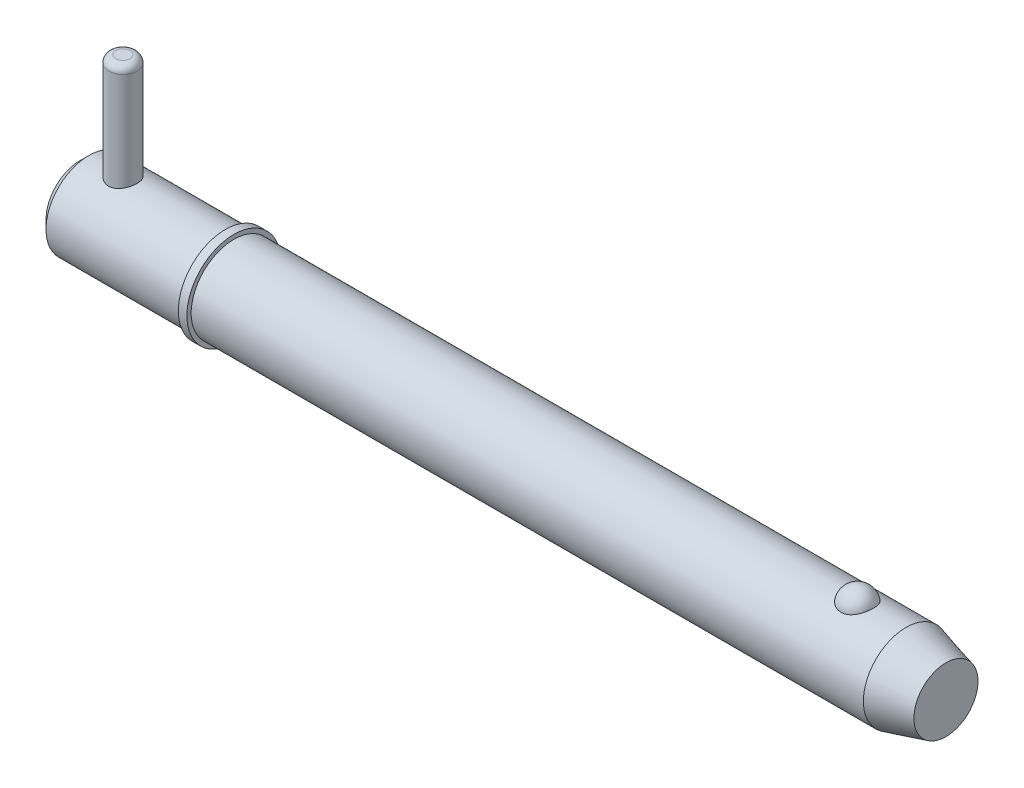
ISO-10303-21;
HEADER;
FILE_DESCRIPTION(('STEP AP214'),'2;1');
FILE_NAME('part.step','',(''),(''),'','','');
FILE_SCHEMA(('AUTOMOTIVE_DESIGN { 1 0 10303 214 1 1 1 1 }'));
ENDSEC;
DATA;
#1=APPLICATION_CONTEXT('core data for automotive mechanical design processes');
#2=APPLICATION_PROTOCOL_DEFINITION('international standard','automotive_design',2000,#1);
#3=PRODUCT_CONTEXT('',#1,'mechanical');
#4=PRODUCT('Part','Part','',(#3));
#5=PRODUCT_RELATED_PRODUCT_CATEGORY('part','',(#4));
#6=PRODUCT_DEFINITION_FORMATION('','',#4);
#7=PRODUCT_DEFINITION_CONTEXT('part definition',#1,'design');
#8=PRODUCT_DEFINITION('design','',#6,#7);
#9=PRODUCT_DEFINITION_SHAPE('','',#8);
#10=(LENGTH_UNIT() NAMED_UNIT(*) SI_UNIT(.MILLI.,.METRE.));
#11=(NAMED_UNIT(*) PLANE_ANGLE_UNIT() SI_UNIT($,.RADIAN.));
#12=(NAMED_UNIT(*) SI_UNIT($,.STERADIAN.) SOLID_ANGLE_UNIT());
#13=UNCERTAINTY_MEASURE_WITH_UNIT(LENGTH_MEASURE(1.E-05),#10,'distance_accuracy_value','');
#14=(GEOMETRIC_REPRESENTATION_CONTEXT(3) GLOBAL_UNCERTAINTY_ASSIGNED_CONTEXT((#13)) GLOBAL_UNIT_ASSIGNED_CONTEXT((#10,
#11,#12)) REPRESENTATION_CONTEXT('',''));
#15=CARTESIAN_POINT('',(0.,0.,0.));
#16=DIRECTION('',(0.,0.,1.));
#17=DIRECTION('',(1.,0.,0.));
#18=AXIS2_PLACEMENT_3D('',#15,#16,#17);
#19=CARTESIAN_POINT('',(7.14,24.605,0.));
#20=DIRECTION('',(0.,-1.,0.));
#21=DIRECTION('',(0.,0.,-1.));
#22=AXIS2_PLACEMENT_3D('',#19,#20,#21);
#23=CYLINDRICAL_SURFACE('',#22,2.38);
#24=CARTESIAN_POINT('',(7.14,-5.955,0.));
#25=DIRECTION('',(0.,1.,0.));
#26=DIRECTION('',(0.,0.,1.));
#27=AXIS2_PLACEMENT_3D('',#24,#25,#26);
#28=CIRCLE('',#27,2.38);
#29=CARTESIAN_POINT('',(7.14,-5.955,2.38));
#30=VERTEX_POINT('',#29);
#31=EDGE_CURVE('P0_E25',#30,#30,#28,.T.);
#32=ORIENTED_EDGE('',*,*,#31,.T.);
#33=EDGE_LOOP('',(#32));
#34=FACE_BOUND('',#33,.T.);
#35=CARTESIAN_POINT('',(7.14,23.415,0.));
#36=DIRECTION('',(0.,1.,0.));
#37=DIRECTION('',(0.,0.,1.));
#38=AXIS2_PLACEMENT_3D('',#35,#36,#37);
#39=CIRCLE('',#38,2.38);
#40=CARTESIAN_POINT('',(7.14,23.415,2.38));
#41=VERTEX_POINT('',#40);
#42=EDGE_CURVE('P0_E29',#41,#41,#39,.F.);
#43=ORIENTED_EDGE('',*,*,#42,.T.);
#44=EDGE_LOOP('',(#43));
#45=FACE_BOUND('',#44,.T.);
#46=ADVANCED_FACE('P0_F14',(#34,#45),#23,.T.);
#47=CARTESIAN_POINT('',(7.14,24.605,0.));
#48=DIRECTION('',(0.,1.,0.));
#49=DIRECTION('',(0.,0.,1.));
#50=AXIS2_PLACEMENT_3D('',#47,#48,#49);
#51=PLANE('',#50);
#52=CARTESIAN_POINT('',(7.14,24.605,0.));
#53=DIRECTION('',(0.,1.,0.));
#54=DIRECTION('',(0.,0.,1.));
#55=AXIS2_PLACEMENT_3D('',#52,#53,#54);
#56=CIRCLE('',#55,1.19);
#57=CARTESIAN_POINT('',(7.14,24.605,1.19));
#58=VERTEX_POINT('',#57);
#59=EDGE_CURVE('P0_E10',#58,#58,#56,.T.);
#60=ORIENTED_EDGE('',*,*,#59,.T.);
#61=EDGE_LOOP('',(#60));
#62=FACE_BOUND('',#61,.T.);
#63=ADVANCED_FACE('P0_F46',(#62),#51,.T.);
#64=CARTESIAN_POINT('',(7.14,-7.145,0.));
#65=DIRECTION('',(0.,1.,0.));
#66=DIRECTION('',(0.,0.,1.));
#67=AXIS2_PLACEMENT_3D('',#64,#65,#66);
#68=PLANE('',#67);
#69=CARTESIAN_POINT('',(7.14,-7.145,0.));
#70=DIRECTION('',(0.,1.,0.));
#71=DIRECTION('',(0.,0.,1.));
#72=AXIS2_PLACEMENT_3D('',#69,#70,#71);
#73=CIRCLE('',#72,1.19);
#74=CARTESIAN_POINT('',(7.14,-7.145,1.19));
#75=VERTEX_POINT('',#74);
#76=EDGE_CURVE('P0_E21',#75,#75,#73,.F.);
#77=ORIENTED_EDGE('',*,*,#76,.T.);
#78=EDGE_LOOP('',(#77));
#79=FACE_BOUND('',#78,.T.);
#80=ADVANCED_FACE('P0_F43',(#79),#68,.F.);
#81=CARTESIAN_POINT('',(7.14,-5.955,0.));
#82=DIRECTION('',(0.,1.,0.));
#83=DIRECTION('',(0.,0.,1.));
#84=AXIS2_PLACEMENT_3D('',#81,#82,#83);
#85=DEGENERATE_TOROIDAL_SURFACE('',#84,1.19,1.19,.T.);
#86=ORIENTED_EDGE('',*,*,#76,.F.);
#87=EDGE_LOOP('',(#86));
#88=FACE_BOUND('',#87,.T.);
#89=ORIENTED_EDGE('',*,*,#31,.F.);
#90=EDGE_LOOP('',(#89));
#91=FACE_BOUND('',#90,.T.);
#92=ADVANCED_FACE('P0_F38',(#88,#91),#85,.T.);
#93=CARTESIAN_POINT('',(7.14,23.415,0.));
#94=DIRECTION('',(0.,1.,0.));
#95=DIRECTION('',(0.,0.,1.));
#96=AXIS2_PLACEMENT_3D('',#93,#94,#95);
#97=DEGENERATE_TOROIDAL_SURFACE('',#96,1.19,1.19,.T.);
#98=ORIENTED_EDGE('',*,*,#42,.F.);
#99=EDGE_LOOP('',(#98));
#100=FACE_BOUND('',#99,.T.);
#101=ORIENTED_EDGE('',*,*,#59,.F.);
#102=EDGE_LOOP('',(#101));
#103=FACE_BOUND('',#102,.T.);
#104=ADVANCED_FACE('P0_F16',(#100,#103),#97,.T.);
#105=CLOSED_SHELL('',(#46,#63,#80,#92,#104));
#106=MANIFOLD_SOLID_BREP('P0_B1',#105);
#107=CARTESIAN_POINT('',(0.,0.,0.));
#108=DIRECTION('',(1.,0.,0.));
#109=DIRECTION('',(0.,0.,-1.));
#110=AXIS2_PLACEMENT_3D('',#107,#108,#109);
#111=CYLINDRICAL_SURFACE('',#110,7.145);
#112=CARTESIAN_POINT('',(138.08362424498,0.,0.));
#113=DIRECTION('',(1.,0.,0.));
#114=DIRECTION('',(0.,0.,-1.));
#115=AXIS2_PLACEMENT_3D('',#112,#113,#114);
#116=CIRCLE('',#115,7.145);
#117=CARTESIAN_POINT('',(138.08362424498,0.,-7.145));
#118=VERTEX_POINT('',#117);
#119=EDGE_CURVE('P1_E81',#118,#118,#116,.T.);
#120=ORIENTED_EDGE('',*,*,#119,.F.);
#121=EDGE_LOOP('',(#120));
#122=FACE_BOUND('',#121,.T.);
#123=CARTESIAN_POINT('',(25.7,0.,0.));
#124=DIRECTION('',(1.,0.,0.));
#125=DIRECTION('',(0.,0.,-1.));
#126=AXIS2_PLACEMENT_3D('',#123,#124,#125);
#127=CIRCLE('',#126,7.145);
#128=CARTESIAN_POINT('',(25.7,0.,-7.145));
#129=VERTEX_POINT('',#128);
#130=EDGE_CURVE('P1_E85',#129,#129,#127,.T.);
#131=ORIENTED_EDGE('',*,*,#130,.T.);
#132=EDGE_LOOP('',(#131));
#133=FACE_BOUND('',#132,.T.);
#134=CARTESIAN_POINT('',(129.939503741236,6.60328629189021,2.72903557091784));
#135=CARTESIAN_POINT('',(129.798315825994,6.60329644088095,2.7290249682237));
#136=CARTESIAN_POINT('',(129.656883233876,6.60799490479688,2.71772840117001));
#137=CARTESIAN_POINT('',(129.377955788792,6.62628236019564,2.6728193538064));
#138=CARTESIAN_POINT('',(129.240472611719,6.63989534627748,2.63914664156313));
#139=CARTESIAN_POINT('',(128.973889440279,6.67440775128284,2.55059642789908));
#140=CARTESIAN_POINT('',(128.844768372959,6.69528793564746,2.49577486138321));
#141=CARTESIAN_POINT('',(128.597869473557,6.74205585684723,2.36651799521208));
#142=CARTESIAN_POINT('',(128.480086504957,6.76794130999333,2.2920916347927));
#143=CARTESIAN_POINT('',(128.25516710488,6.82286177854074,2.12312937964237));
#144=CARTESIAN_POINT('',(128.148440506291,6.85196655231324,2.0280710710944));
#145=CARTESIAN_POINT('',(127.951918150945,6.90970232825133,1.82167822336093));
#146=CARTESIAN_POINT('',(127.862127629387,6.93833318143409,1.71033867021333));
#147=CARTESIAN_POINT('',(127.697667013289,6.9935167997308,1.46891951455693));
#148=CARTESIAN_POINT('',(127.623844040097,7.01992110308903,1.33822781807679));
#149=CARTESIAN_POINT('',(127.498088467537,7.06643385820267,1.0656656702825));
#150=CARTESIAN_POINT('',(127.44615735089,7.08654188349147,0.923794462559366));
#151=CARTESIAN_POINT('',(127.364732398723,7.11862399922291,0.630993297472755));
#152=CARTESIAN_POINT('',(127.335516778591,7.13049704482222,0.479974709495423));
#153=CARTESIAN_POINT('',(127.301174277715,7.14449484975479,0.174782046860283));
#154=CARTESIAN_POINT('',(127.296046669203,7.14661990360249,0.020608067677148));
#155=CARTESIAN_POINT('',(127.309938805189,7.14092465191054,-0.285506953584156));
#156=CARTESIAN_POINT('',(127.328810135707,7.1331654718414,-0.437455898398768));
#157=CARTESIAN_POINT('',(127.390062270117,7.10859076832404,-0.73577860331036));
#158=CARTESIAN_POINT('',(127.432443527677,7.0917750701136,-0.882152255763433));
#159=CARTESIAN_POINT('',(127.539934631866,7.05076716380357,-1.16543149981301));
#160=CARTESIAN_POINT('',(127.605075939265,7.02656475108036,-1.30232366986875));
#161=CARTESIAN_POINT('',(127.756759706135,6.97329145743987,-1.56265907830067));
#162=CARTESIAN_POINT('',(127.843303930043,6.94422017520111,-1.68610120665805));
#163=CARTESIAN_POINT('',(128.036465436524,6.88415108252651,-1.91671004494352));
#164=CARTESIAN_POINT('',(128.143180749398,6.85314438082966,-2.02379244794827));
#165=CARTESIAN_POINT('',(128.373974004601,6.79282069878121,-2.21787433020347));
#166=CARTESIAN_POINT('',(128.498050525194,6.76350358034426,-2.30487545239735));
#167=CARTESIAN_POINT('',(128.757678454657,6.71060580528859,-2.45458647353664));
#168=CARTESIAN_POINT('',(128.892938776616,6.68691885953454,-2.51776240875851));
#169=CARTESIAN_POINT('',(129.173277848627,6.64741247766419,-2.62030218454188));
#170=CARTESIAN_POINT('',(129.318352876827,6.63159007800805,-2.65967499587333));
#171=CARTESIAN_POINT('',(129.606347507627,6.61038594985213,-2.71193301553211));
#172=CARTESIAN_POINT('',(129.74900807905,6.60451880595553,-2.72605165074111));
#173=CARTESIAN_POINT('',(130.034800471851,6.60240611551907,-2.73116688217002));
#174=CARTESIAN_POINT('',(130.177932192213,6.60615862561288,-2.7221681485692));
#175=CARTESIAN_POINT('',(130.455848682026,6.62256094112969,-2.68200435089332));
#176=CARTESIAN_POINT('',(130.590754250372,6.63492533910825,-2.65154998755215));
#177=CARTESIAN_POINT('',(130.85332009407,6.66687445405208,-2.57015684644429));
#178=CARTESIAN_POINT('',(130.98097978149,6.68645975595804,-2.51921640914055));
#179=CARTESIAN_POINT('',(131.228577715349,6.73127274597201,-2.39693610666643));
#180=CARTESIAN_POINT('',(131.348287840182,6.7566138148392,-2.32517694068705));
#181=CARTESIAN_POINT('',(131.574159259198,6.81006003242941,-2.16363812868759));
#182=CARTESIAN_POINT('',(131.680317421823,6.83816581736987,-2.07385432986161));
#183=CARTESIAN_POINT('',(131.881862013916,6.89580469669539,-1.87357235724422));
#184=CARTESIAN_POINT('',(131.976440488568,6.92533863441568,-1.76226074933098));
#185=CARTESIAN_POINT('',(132.146332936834,6.98139526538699,-1.5251169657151));
#186=CARTESIAN_POINT('',(132.221643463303,7.0079174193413,-1.39928219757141));
#187=CARTESIAN_POINT('',(132.353595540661,7.05607625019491,-1.1321597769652));
#188=CARTESIAN_POINT('',(132.409568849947,7.07753119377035,-0.990508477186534));
#189=CARTESIAN_POINT('',(132.498296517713,7.11222355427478,-0.699154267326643));
#190=CARTESIAN_POINT('',(132.531050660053,7.12546089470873,-0.549451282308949));
#191=CARTESIAN_POINT('',(132.572689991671,7.14237584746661,-0.246120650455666));
#192=CARTESIAN_POINT('',(132.581558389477,7.14604673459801,-0.0924903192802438));
#193=CARTESIAN_POINT('',(132.575194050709,7.14343510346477,0.214181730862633));
#194=CARTESIAN_POINT('',(132.559961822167,7.13715279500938,0.367223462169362));
#195=CARTESIAN_POINT('',(132.505845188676,7.1153294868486,0.667595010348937));
#196=CARTESIAN_POINT('',(132.467077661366,7.09983424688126,0.814949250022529));
#197=CARTESIAN_POINT('',(132.366770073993,7.06119140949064,1.1006322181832));
#198=CARTESIAN_POINT('',(132.305228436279,7.03804328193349,1.23896032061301));
#199=CARTESIAN_POINT('',(132.160207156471,6.98632429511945,1.50352300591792));
#200=CARTESIAN_POINT('',(132.076606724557,6.95772382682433,1.62968561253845));
#201=CARTESIAN_POINT('',(131.88938046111,6.89823072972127,1.86554304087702));
#202=CARTESIAN_POINT('',(131.785755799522,6.86733823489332,1.97523882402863));
#203=CARTESIAN_POINT('',(131.561076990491,6.80676456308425,2.174822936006));
#204=CARTESIAN_POINT('',(131.440067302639,6.7770805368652,2.26476035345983));
#205=CARTESIAN_POINT('',(131.183340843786,6.7223050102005,2.42252989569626));
#206=CARTESIAN_POINT('',(131.04761851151,6.69721525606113,2.4903536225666));
#207=CARTESIAN_POINT('',(130.770402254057,6.65552591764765,2.59967646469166));
#208=CARTESIAN_POINT('',(130.629281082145,6.63865794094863,2.6420201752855));
#209=CARTESIAN_POINT('',(130.341444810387,6.61425039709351,2.70255841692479));
#210=CARTESIAN_POINT('',(130.194748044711,6.606682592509,2.72082606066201));
#211=CARTESIAN_POINT('',(130.011679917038,6.60358754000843,2.72830331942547));
#212=CARTESIAN_POINT('',(129.975599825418,6.60328369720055,2.72903828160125));
#213=CARTESIAN_POINT('',(129.939503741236,6.60328629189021,2.72903557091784));
#214=B_SPLINE_CURVE_WITH_KNOTS('',3,(#134,#135,#136,#137,#138,#139,#140,#141,#142,#143,#144,
#145,#146,#147,#148,#149,#150,#151,#152,#153,#154,#155,#156,#157,#158,#159,#160,#161,#162,#163,
#164,#165,#166,#167,#168,#169,#170,#171,#172,#173,#174,#175,#176,#177,#178,#179,#180,#181,#182,
#183,#184,#185,#186,#187,#188,#189,#190,#191,#192,#193,#194,#195,#196,#197,#198,#199,#200,#201,
#202,#203,#204,#205,#206,#207,#208,#209,#210,#211,#212,#213),.UNSPECIFIED.,.T.,.F.,(4,2,2,2,2,2,
2,2,2,2,2,2,2,2,2,2,2,2,2,2,2,2,2,2,2,2,2,2,2,2,2,2,2,2,2,2,2,2,2,4),(0.,0.423468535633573,
0.848081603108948,1.27157926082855,1.69488414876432,2.13051395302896,2.56627819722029,
3.02136706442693,3.47648674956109,3.93709649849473,4.39769233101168,4.85545355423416,
5.31322361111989,5.77162895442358,6.23007210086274,6.6908033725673,7.15149693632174,
7.60264329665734,8.05361952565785,8.48189729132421,8.91008854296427,9.32472524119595,
9.73939553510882,10.1630783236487,10.5868588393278,11.0319070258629,11.4770347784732,
11.9362874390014,12.3955443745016,12.8551240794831,13.3146940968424,13.7720003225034,
14.2293382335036,14.6892343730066,15.1491036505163,15.6078171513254,16.0667046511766,
16.5093965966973,16.9507410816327,17.0590049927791),.UNSPECIFIED.);
#215=CARTESIAN_POINT('',(129.939503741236,6.60328629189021,2.72903557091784));
#216=VERTEX_POINT('',#215);
#217=EDGE_CURVE('P1_E35',#216,#216,#214,.T.);
#218=ORIENTED_EDGE('',*,*,#217,.T.);
#219=EDGE_LOOP('',(#218));
#220=FACE_BOUND('',#219,.T.);
#221=ADVANCED_FACE('P1_F13',(#122,#133,#220),#111,.T.);
#222=CARTESIAN_POINT('',(0.,0.,0.));
#223=DIRECTION('',(-1.,0.,0.));
#224=DIRECTION('',(0.,0.,1.));
#225=AXIS2_PLACEMENT_3D('',#222,#223,#224);
#226=PLANE('',#225);
#227=CARTESIAN_POINT('',(0.,0.,0.));
#228=DIRECTION('',(1.,0.,0.));
#229=DIRECTION('',(0.,0.,-1.));
#230=AXIS2_PLACEMENT_3D('',#227,#228,#229);
#231=CIRCLE('',#230,5.716);
#232=CARTESIAN_POINT('',(0.,0.,-5.716));
#233=VERTEX_POINT('',#232);
#234=EDGE_CURVE('P1_E9',#233,#233,#231,.T.);
#235=ORIENTED_EDGE('',*,*,#234,.F.);
#236=EDGE_LOOP('',(#235));
#237=FACE_BOUND('',#236,.T.);
#238=ADVANCED_FACE('P1_F15',(#237),#226,.T.);
#239=CARTESIAN_POINT('',(1.42899999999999,0.,0.));
#240=DIRECTION('',(1.,0.,0.));
#241=DIRECTION('',(0.,0.,-1.));
#242=AXIS2_PLACEMENT_3D('',#239,#240,#241);
#243=CONICAL_SURFACE('',#242,7.145,0.78539816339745);
#244=ORIENTED_EDGE('',*,*,#234,.T.);
#245=EDGE_LOOP('',(#244));
#246=FACE_BOUND('',#245,.T.);
#247=CARTESIAN_POINT('',(1.42899999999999,0.,0.));
#248=DIRECTION('',(1.,0.,0.));
#249=DIRECTION('',(0.,0.,-1.));
#250=AXIS2_PLACEMENT_3D('',#247,#248,#249);
#251=CIRCLE('',#250,7.145);
#252=CARTESIAN_POINT('',(1.42899999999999,0.,-7.145));
#253=VERTEX_POINT('',#252);
#254=EDGE_CURVE('P1_E26',#253,#253,#251,.T.);
#255=ORIENTED_EDGE('',*,*,#254,.F.);
#256=EDGE_LOOP('',(#255));
#257=FACE_BOUND('',#256,.T.);
#258=ADVANCED_FACE('P1_F77',(#246,#257),#243,.T.);
#259=CARTESIAN_POINT('',(0.,0.,0.));
#260=DIRECTION('',(1.,0.,0.));
#261=DIRECTION('',(0.,0.,-1.));
#262=AXIS2_PLACEMENT_3D('',#259,#260,#261);
#263=CYLINDRICAL_SURFACE('',#262,7.145);
#264=CARTESIAN_POINT('',(7.14,-6.73695962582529,2.38));
#265=CARTESIAN_POINT('',(7.01035997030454,-6.73695921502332,2.38000059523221));
#266=CARTESIAN_POINT('',(6.88072348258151,-6.74074253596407,2.36937183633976));
#267=CARTESIAN_POINT('',(6.62529075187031,-6.75538853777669,2.32728080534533));
#268=CARTESIAN_POINT('',(6.49949514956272,-6.76625239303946,2.29581507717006));
#269=CARTESIAN_POINT('',(6.2554858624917,-6.79369535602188,2.21327763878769));
#270=CARTESIAN_POINT('',(6.13725786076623,-6.81026326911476,2.16224430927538));
#271=CARTESIAN_POINT('',(5.91100349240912,-6.84723128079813,2.04215132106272));
#272=CARTESIAN_POINT('',(5.80297937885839,-6.86763222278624,1.97308769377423));
#273=CARTESIAN_POINT('',(5.59597854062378,-6.91086152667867,1.81600414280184));
#274=CARTESIAN_POINT('',(5.49745861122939,-6.93375032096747,1.72739874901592));
#275=CARTESIAN_POINT('',(5.31636508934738,-6.97886546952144,1.53499636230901));
#276=CARTESIAN_POINT('',(5.23379405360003,-7.00109171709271,1.43119693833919));
#277=CARTESIAN_POINT('',(5.08487013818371,-7.04307708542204,1.20801318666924));
#278=CARTESIAN_POINT('',(5.01899578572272,-7.06275685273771,1.08829330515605));
#279=CARTESIAN_POINT('',(4.90850130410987,-7.09671988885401,0.838703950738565));
#280=CARTESIAN_POINT('',(4.86387545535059,-7.11100460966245,0.70883722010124));
#281=CARTESIAN_POINT('',(4.79869354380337,-7.13213998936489,0.44742990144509));
#282=CARTESIAN_POINT('',(4.77735497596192,-7.13923172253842,0.316104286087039));
#283=CARTESIAN_POINT('',(4.75686536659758,-7.14603777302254,0.0515578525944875));
#284=CARTESIAN_POINT('',(4.75770861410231,-7.14575398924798,-0.0816624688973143));
#285=CARTESIAN_POINT('',(4.78106216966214,-7.13800438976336,-0.340678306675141));
#286=CARTESIAN_POINT('',(4.80272255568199,-7.13082030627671,-0.466560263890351));
#287=CARTESIAN_POINT('',(4.86569013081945,-7.11043095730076,-0.712788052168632));
#288=CARTESIAN_POINT('',(4.90699865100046,-7.09722528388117,-0.833133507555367));
#289=CARTESIAN_POINT('',(5.00858673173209,-7.06591754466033,-1.06673173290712));
#290=CARTESIAN_POINT('',(5.06910834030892,-7.0477534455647,-1.17987058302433));
#291=CARTESIAN_POINT('',(5.20720514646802,-7.00841977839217,-1.39463797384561));
#292=CARTESIAN_POINT('',(5.28478508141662,-6.987249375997,-1.49626330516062));
#293=CARTESIAN_POINT('',(5.4590800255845,-6.94296010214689,-1.69017445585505));
#294=CARTESIAN_POINT('',(5.55652324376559,-6.91979641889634,-1.78179645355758));
#295=CARTESIAN_POINT('',(5.76558873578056,-6.87497076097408,-1.94761348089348));
#296=CARTESIAN_POINT('',(5.87721318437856,-6.85330901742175,-2.02180583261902));
#297=CARTESIAN_POINT('',(6.11357367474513,-6.81369485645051,-2.15157488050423));
#298=CARTESIAN_POINT('',(6.23847358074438,-6.79579956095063,-2.20687188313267));
#299=CARTESIAN_POINT('',(6.49655785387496,-6.76640630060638,-2.29542443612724));
#300=CARTESIAN_POINT('',(6.62973872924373,-6.75490565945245,-2.32868920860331));
#301=CARTESIAN_POINT('',(6.89417536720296,-6.74020933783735,-2.37088225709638));
#302=CARTESIAN_POINT('',(7.02524746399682,-6.73666278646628,-2.38083959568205));
#303=CARTESIAN_POINT('',(7.28721035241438,-6.73729555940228,-2.37904974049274));
#304=CARTESIAN_POINT('',(7.41810117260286,-6.7414734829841,-2.36730648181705));
#305=CARTESIAN_POINT('',(7.67130717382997,-6.75673471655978,-2.32337336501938));
#306=CARTESIAN_POINT('',(7.79376251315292,-6.76757635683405,-2.29189834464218));
#307=CARTESIAN_POINT('',(8.03162917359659,-6.79467771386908,-2.21025275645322));
#308=CARTESIAN_POINT('',(8.14703924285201,-6.8109383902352,-2.16007887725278));
#309=CARTESIAN_POINT('',(8.37159169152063,-6.84768362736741,-2.04065289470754));
#310=CARTESIAN_POINT('',(8.48041962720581,-6.86828569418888,-1.97084668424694));
#311=CARTESIAN_POINT('',(8.68518919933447,-6.91116416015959,-1.8147657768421));
#312=CARTESIAN_POINT('',(8.78112702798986,-6.93344105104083,-1.72848623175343));
#313=CARTESIAN_POINT('',(8.96215574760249,-6.97845348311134,-1.53698616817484));
#314=CARTESIAN_POINT('',(9.04650427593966,-7.00115965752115,-1.43105491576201));
#315=CARTESIAN_POINT('',(9.19627592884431,-7.04341676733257,-1.20598377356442));
#316=CARTESIAN_POINT('',(9.26169972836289,-7.06296781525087,-1.08684435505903));
#317=CARTESIAN_POINT('',(9.37116617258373,-7.0966205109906,-0.83933303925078));
#318=CARTESIAN_POINT('',(9.41534821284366,-7.11075755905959,-0.711027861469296));
#319=CARTESIAN_POINT('',(9.48132660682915,-7.13214194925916,-0.448245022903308));
#320=CARTESIAN_POINT('',(9.50313102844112,-7.13939177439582,-0.313769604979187));
#321=CARTESIAN_POINT('',(9.5230098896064,-7.14599771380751,-0.049254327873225));
#322=CARTESIAN_POINT('',(9.52215013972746,-7.14570837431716,0.0806974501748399));
#323=CARTESIAN_POINT('',(9.49935359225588,-7.13814116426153,0.338518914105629));
#324=CARTESIAN_POINT('',(9.47741850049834,-7.13086385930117,0.466388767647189));
#325=CARTESIAN_POINT('',(9.4138005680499,-7.11026814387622,0.714400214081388));
#326=CARTESIAN_POINT('',(9.37243609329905,-7.09704726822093,0.834632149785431));
#327=CARTESIAN_POINT('',(9.27142829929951,-7.06592602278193,1.06649582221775));
#328=CARTESIAN_POINT('',(9.2117816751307,-7.04802480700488,1.1781259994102));
#329=CARTESIAN_POINT('',(9.07336776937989,-7.00856499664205,1.39411030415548));
#330=CARTESIAN_POINT('',(8.99397590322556,-6.98689577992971,1.49804368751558));
#331=CARTESIAN_POINT('',(8.81938810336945,-6.9426110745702,1.69146078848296));
#332=CARTESIAN_POINT('',(8.72418713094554,-6.91999528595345,1.78093988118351));
#333=CARTESIAN_POINT('',(8.51623540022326,-6.87531507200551,1.94646188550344));
#334=CARTESIAN_POINT('',(8.4029442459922,-6.85330672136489,2.02184316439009));
#335=CARTESIAN_POINT('',(8.16461714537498,-6.81342065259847,2.1524427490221));
#336=CARTESIAN_POINT('',(8.03958429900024,-6.7955418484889,2.20766635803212));
#337=CARTESIAN_POINT('',(7.78712566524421,-6.76686117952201,2.29403636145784));
#338=CARTESIAN_POINT('',(7.66006989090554,-6.75577342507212,2.32616709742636));
#339=CARTESIAN_POINT('',(7.40200728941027,-6.74082409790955,2.36914495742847));
#340=CARTESIAN_POINT('',(7.27100183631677,-6.73696004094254,2.37999939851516));
#341=CARTESIAN_POINT('',(7.14,-6.73695962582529,2.38));
#342=B_SPLINE_CURVE_WITH_KNOTS('',3,(#264,#265,#266,#267,#268,#269,#270,#271,#272,#273,#274,
#275,#276,#277,#278,#279,#280,#281,#282,#283,#284,#285,#286,#287,#288,#289,#290,#291,#292,#293,
#294,#295,#296,#297,#298,#299,#300,#301,#302,#303,#304,#305,#306,#307,#308,#309,#310,#311,#312,
#313,#314,#315,#316,#317,#318,#319,#320,#321,#322,#323,#324,#325,#326,#327,#328,#329,#330,#331,
#332,#333,#334,#335,#336,#337,#338,#339,#340,#341),.UNSPECIFIED.,.T.,.F.,(4,2,2,2,2,2,2,2,2,2,2,
2,2,2,2,2,2,2,2,2,2,2,2,2,2,2,2,2,2,2,2,2,2,2,2,2,2,2,4),(0.,0.388434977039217,
0.776934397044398,1.16467566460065,1.55250234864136,1.9540847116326,2.35573139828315,
2.76784120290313,3.17984001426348,3.57752248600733,3.97510257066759,4.35711073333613,
4.7391447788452,5.12619663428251,5.51335611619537,5.91871976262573,6.3241456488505,
6.73533623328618,7.14635459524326,7.53885245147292,7.93127914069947,8.31025106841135,
8.68929014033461,9.08033871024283,9.47150254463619,9.88145528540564,10.2913934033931,
10.6986033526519,11.1056664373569,11.4936225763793,11.8815473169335,12.2633262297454,
12.645174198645,13.0411187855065,13.437189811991,13.8487371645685,14.2601761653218,
14.6528265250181,15.0453418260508),.UNSPECIFIED.);
#343=CARTESIAN_POINT('',(7.14,-6.73695962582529,2.38));
#344=VERTEX_POINT('',#343);
#345=EDGE_CURVE('P1_E17',#344,#344,#342,.T.);
#346=ORIENTED_EDGE('',*,*,#345,.F.);
#347=EDGE_LOOP('',(#346));
#348=FACE_BOUND('',#347,.T.);
#349=CARTESIAN_POINT('',(7.14,6.73695962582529,2.38));
#350=CARTESIAN_POINT('',(7.26964002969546,6.73695921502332,2.38000059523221));
#351=CARTESIAN_POINT('',(7.39927651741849,6.74074253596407,2.36937183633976));
#352=CARTESIAN_POINT('',(7.65470924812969,6.75538853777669,2.32728080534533));
#353=CARTESIAN_POINT('',(7.78050485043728,6.76625239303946,2.29581507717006));
#354=CARTESIAN_POINT('',(8.02451413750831,6.79369535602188,2.21327763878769));
#355=CARTESIAN_POINT('',(8.14274213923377,6.81026326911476,2.16224430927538));
#356=CARTESIAN_POINT('',(8.36899650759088,6.84723128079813,2.04215132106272));
#357=CARTESIAN_POINT('',(8.47702062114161,6.86763222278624,1.97308769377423));
#358=CARTESIAN_POINT('',(8.68402145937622,6.91086152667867,1.81600414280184));
#359=CARTESIAN_POINT('',(8.78254138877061,6.93375032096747,1.72739874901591));
#360=CARTESIAN_POINT('',(8.96363491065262,6.97886546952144,1.53499636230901));
#361=CARTESIAN_POINT('',(9.04620594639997,7.00109171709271,1.43119693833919));
#362=CARTESIAN_POINT('',(9.19512986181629,7.04307708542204,1.20801318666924));
#363=CARTESIAN_POINT('',(9.26100421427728,7.06275685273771,1.08829330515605));
#364=CARTESIAN_POINT('',(9.37149869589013,7.09671988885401,0.838703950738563));
#365=CARTESIAN_POINT('',(9.41612454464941,7.11100460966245,0.708837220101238));
#366=CARTESIAN_POINT('',(9.48130645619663,7.13213998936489,0.447429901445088));
#367=CARTESIAN_POINT('',(9.50264502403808,7.13923172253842,0.316104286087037));
#368=CARTESIAN_POINT('',(9.52313463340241,7.14603777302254,0.0515578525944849));
#369=CARTESIAN_POINT('',(9.52229138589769,7.14575398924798,-0.0816624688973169));
#370=CARTESIAN_POINT('',(9.49893783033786,7.13800438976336,-0.340678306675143));
#371=CARTESIAN_POINT('',(9.47727744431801,7.13082030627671,-0.466560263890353));
#372=CARTESIAN_POINT('',(9.41430986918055,7.11043095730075,-0.712788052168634));
#373=CARTESIAN_POINT('',(9.37300134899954,7.09722528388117,-0.833133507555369));
#374=CARTESIAN_POINT('',(9.27141326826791,7.06591754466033,-1.06673173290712));
#375=CARTESIAN_POINT('',(9.21089165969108,7.0477534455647,-1.17987058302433));
#376=CARTESIAN_POINT('',(9.07279485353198,7.00841977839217,-1.39463797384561));
#377=CARTESIAN_POINT('',(8.99521491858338,6.987249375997,-1.49626330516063));
#378=CARTESIAN_POINT('',(8.82091997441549,6.94296010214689,-1.69017445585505));
#379=CARTESIAN_POINT('',(8.72347675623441,6.91979641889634,-1.78179645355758));
#380=CARTESIAN_POINT('',(8.51441126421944,6.87497076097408,-1.94761348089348));
#381=CARTESIAN_POINT('',(8.40278681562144,6.85330901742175,-2.02180583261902));
#382=CARTESIAN_POINT('',(8.16642632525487,6.81369485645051,-2.15157488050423));
#383=CARTESIAN_POINT('',(8.04152641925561,6.79579956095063,-2.20687188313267));
#384=CARTESIAN_POINT('',(7.78344214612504,6.76640630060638,-2.29542443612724));
#385=CARTESIAN_POINT('',(7.65026127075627,6.75490565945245,-2.32868920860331));
#386=CARTESIAN_POINT('',(7.38582463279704,6.74020933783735,-2.37088225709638));
#387=CARTESIAN_POINT('',(7.25475253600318,6.73666278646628,-2.38083959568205));
#388=CARTESIAN_POINT('',(6.99278964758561,6.73729555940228,-2.37904974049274));
#389=CARTESIAN_POINT('',(6.86189882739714,6.7414734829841,-2.36730648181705));
#390=CARTESIAN_POINT('',(6.60869282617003,6.75673471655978,-2.32337336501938));
#391=CARTESIAN_POINT('',(6.48623748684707,6.76757635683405,-2.29189834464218));
#392=CARTESIAN_POINT('',(6.2483708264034,6.79467771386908,-2.21025275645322));
#393=CARTESIAN_POINT('',(6.13296075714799,6.8109383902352,-2.16007887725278));
#394=CARTESIAN_POINT('',(5.90840830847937,6.84768362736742,-2.04065289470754));
#395=CARTESIAN_POINT('',(5.79958037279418,6.86828569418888,-1.97084668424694));
#396=CARTESIAN_POINT('',(5.59481080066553,6.91116416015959,-1.8147657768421));
#397=CARTESIAN_POINT('',(5.49887297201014,6.93344105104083,-1.72848623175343));
#398=CARTESIAN_POINT('',(5.31784425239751,6.97845348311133,-1.53698616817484));
#399=CARTESIAN_POINT('',(5.23349572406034,7.00115965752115,-1.43105491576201));
#400=CARTESIAN_POINT('',(5.08372407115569,7.04341676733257,-1.20598377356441));
#401=CARTESIAN_POINT('',(5.01830027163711,7.06296781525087,-1.08684435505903));
#402=CARTESIAN_POINT('',(4.90883382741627,7.0966205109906,-0.839333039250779));
#403=CARTESIAN_POINT('',(4.86465178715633,7.11075755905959,-0.711027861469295));
#404=CARTESIAN_POINT('',(4.79867339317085,7.13214194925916,-0.448245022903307));
#405=CARTESIAN_POINT('',(4.77686897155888,7.13939177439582,-0.313769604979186));
#406=CARTESIAN_POINT('',(4.7569901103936,7.14599771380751,-0.0492543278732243));
#407=CARTESIAN_POINT('',(4.75784986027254,7.14570837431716,0.0806974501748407));
#408=CARTESIAN_POINT('',(4.78064640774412,7.13814116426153,0.33851891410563));
#409=CARTESIAN_POINT('',(4.80258149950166,7.13086385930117,0.46638876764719));
#410=CARTESIAN_POINT('',(4.8661994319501,7.11026814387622,0.714400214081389));
#411=CARTESIAN_POINT('',(4.90756390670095,7.09704726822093,0.834632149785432));
#412=CARTESIAN_POINT('',(5.00857170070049,7.06592602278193,1.06649582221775));
#413=CARTESIAN_POINT('',(5.0682183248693,7.04802480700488,1.1781259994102));
#414=CARTESIAN_POINT('',(5.20663223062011,7.00856499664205,1.39411030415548));
#415=CARTESIAN_POINT('',(5.28602409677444,6.98689577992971,1.49804368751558));
#416=CARTESIAN_POINT('',(5.46061189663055,6.9426110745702,1.69146078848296));
#417=CARTESIAN_POINT('',(5.55581286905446,6.91999528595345,1.78093988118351));
#418=CARTESIAN_POINT('',(5.76376459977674,6.87531507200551,1.94646188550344));
#419=CARTESIAN_POINT('',(5.8770557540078,6.85330672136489,2.02184316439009));
#420=CARTESIAN_POINT('',(6.11538285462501,6.81342065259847,2.1524427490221));
#421=CARTESIAN_POINT('',(6.24041570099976,6.7955418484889,2.20766635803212));
#422=CARTESIAN_POINT('',(6.4928743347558,6.76686117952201,2.29403636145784));
#423=CARTESIAN_POINT('',(6.61993010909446,6.75577342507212,2.32616709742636));
#424=CARTESIAN_POINT('',(6.87799271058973,6.74082409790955,2.36914495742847));
#425=CARTESIAN_POINT('',(7.00899816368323,6.73696004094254,2.37999939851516));
#426=CARTESIAN_POINT('',(7.14,6.73695962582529,2.38));
#427=B_SPLINE_CURVE_WITH_KNOTS('',3,(#349,#350,#351,#352,#353,#354,#355,#356,#357,#358,#359,
#360,#361,#362,#363,#364,#365,#366,#367,#368,#369,#370,#371,#372,#373,#374,#375,#376,#377,#378,
#379,#380,#381,#382,#383,#384,#385,#386,#387,#388,#389,#390,#391,#392,#393,#394,#395,#396,#397,
#398,#399,#400,#401,#402,#403,#404,#405,#406,#407,#408,#409,#410,#411,#412,#413,#414,#415,#416,
#417,#418,#419,#420,#421,#422,#423,#424,#425,#426),.UNSPECIFIED.,.T.,.F.,(4,2,2,2,2,2,2,2,2,2,2,
2,2,2,2,2,2,2,2,2,2,2,2,2,2,2,2,2,2,2,2,2,2,2,2,2,2,2,4),(0.,0.388434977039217,
0.776934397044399,1.16467566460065,1.55250234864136,1.9540847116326,2.35573139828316,
2.76784120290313,3.17984001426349,3.57752248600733,3.97510257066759,4.35711073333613,
4.73914477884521,5.12619663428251,5.51335611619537,5.91871976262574,6.3241456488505,
6.73533623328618,7.14635459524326,7.53885245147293,7.93127914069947,8.31025106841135,
8.68929014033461,9.08033871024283,9.47150254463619,9.88145528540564,10.2913934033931,
10.6986033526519,11.1056664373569,11.4936225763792,11.8815473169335,12.2633262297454,
12.645174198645,13.0411187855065,13.437189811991,13.8487371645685,14.2601761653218,
14.6528265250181,15.0453418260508),.UNSPECIFIED.);
#428=CARTESIAN_POINT('',(7.14,6.73695962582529,2.38));
#429=VERTEX_POINT('',#428);
#430=EDGE_CURVE('P1_E43',#429,#429,#427,.T.);
#431=ORIENTED_EDGE('',*,*,#430,.F.);
#432=EDGE_LOOP('',(#431));
#433=FACE_BOUND('',#432,.T.);
#434=ORIENTED_EDGE('',*,*,#254,.T.);
#435=EDGE_LOOP('',(#434));
#436=FACE_BOUND('',#435,.T.);
#437=CARTESIAN_POINT('',(24.271,0.,0.));
#438=DIRECTION('',(1.,0.,0.));
#439=DIRECTION('',(0.,0.,-1.));
#440=AXIS2_PLACEMENT_3D('',#437,#438,#439);
#441=CIRCLE('',#440,7.145);
#442=CARTESIAN_POINT('',(24.271,0.,-7.145));
#443=VERTEX_POINT('',#442);
#444=EDGE_CURVE('P1_E31',#443,#443,#441,.T.);
#445=ORIENTED_EDGE('',*,*,#444,.F.);
#446=EDGE_LOOP('',(#445));
#447=FACE_BOUND('',#446,.T.);
#448=ADVANCED_FACE('P1_F103',(#348,#433,#436,#447),#263,.T.);
#449=CARTESIAN_POINT('',(24.271,7.145,0.));
#450=DIRECTION('',(-1.,0.,0.));
#451=DIRECTION('',(0.,0.,1.));
#452=AXIS2_PLACEMENT_3D('',#449,#450,#451);
#453=PLANE('',#452);
#454=ORIENTED_EDGE('',*,*,#444,.T.);
#455=EDGE_LOOP('',(#454));
#456=FACE_BOUND('',#455,.T.);
#457=CARTESIAN_POINT('',(24.271,0.,0.));
#458=DIRECTION('',(1.,0.,0.));
#459=DIRECTION('',(0.,0.,-1.));
#460=AXIS2_PLACEMENT_3D('',#457,#458,#459);
#461=CIRCLE('',#460,7.8595);
#462=CARTESIAN_POINT('',(24.271,0.,-7.8595));
#463=VERTEX_POINT('',#462);
#464=EDGE_CURVE('P1_E91',#463,#463,#461,.T.);
#465=ORIENTED_EDGE('',*,*,#464,.F.);
#466=EDGE_LOOP('',(#465));
#467=FACE_BOUND('',#466,.T.);
#468=ADVANCED_FACE('P1_F100',(#456,#467),#453,.T.);
#469=CARTESIAN_POINT('',(0.,0.,0.));
#470=DIRECTION('',(1.,0.,0.));
#471=DIRECTION('',(0.,0.,-1.));
#472=AXIS2_PLACEMENT_3D('',#469,#470,#471);
#473=CYLINDRICAL_SURFACE('',#472,7.8595);
#474=ORIENTED_EDGE('',*,*,#464,.T.);
#475=EDGE_LOOP('',(#474));
#476=FACE_BOUND('',#475,.T.);
#477=CARTESIAN_POINT('',(25.7,0.,0.));
#478=DIRECTION('',(1.,0.,0.));
#479=DIRECTION('',(0.,0.,-1.));
#480=AXIS2_PLACEMENT_3D('',#477,#478,#479);
#481=CIRCLE('',#480,7.8595);
#482=CARTESIAN_POINT('',(25.7,0.,-7.8595));
#483=VERTEX_POINT('',#482);
#484=EDGE_CURVE('P1_E88',#483,#483,#481,.T.);
#485=ORIENTED_EDGE('',*,*,#484,.F.);
#486=EDGE_LOOP('',(#485));
#487=FACE_BOUND('',#486,.T.);
#488=ADVANCED_FACE('P1_F68',(#476,#487),#473,.T.);
#489=CARTESIAN_POINT('',(25.7,7.8595,0.));
#490=DIRECTION('',(1.,0.,0.));
#491=DIRECTION('',(0.,0.,-1.));
#492=AXIS2_PLACEMENT_3D('',#489,#490,#491);
#493=PLANE('',#492);
#494=ORIENTED_EDGE('',*,*,#484,.T.);
#495=EDGE_LOOP('',(#494));
#496=FACE_BOUND('',#495,.T.);
#497=ORIENTED_EDGE('',*,*,#130,.F.);
#498=EDGE_LOOP('',(#497));
#499=FACE_BOUND('',#498,.T.);
#500=ADVANCED_FACE('P1_F62',(#496,#499),#493,.T.);
#501=CARTESIAN_POINT('',(144.75,0.,0.));
#502=DIRECTION('',(-1.,0.,0.));
#503=DIRECTION('',(0.,0.,1.));
#504=AXIS2_PLACEMENT_3D('',#501,#502,#503);
#505=CONICAL_SURFACE('',#504,5.35875000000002,0.26179938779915);
#506=ORIENTED_EDGE('',*,*,#119,.T.);
#507=EDGE_LOOP('',(#506));
#508=FACE_BOUND('',#507,.T.);
#509=CARTESIAN_POINT('',(144.75,0.,0.));
#510=DIRECTION('',(1.,0.,0.));
#511=DIRECTION('',(0.,0.,-1.));
#512=AXIS2_PLACEMENT_3D('',#509,#510,#511);
#513=CIRCLE('',#512,5.35875000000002);
#514=CARTESIAN_POINT('',(144.75,0.,-5.35875000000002));
#515=VERTEX_POINT('',#514);
#516=EDGE_CURVE('P1_E42',#515,#515,#513,.T.);
#517=ORIENTED_EDGE('',*,*,#516,.F.);
#518=EDGE_LOOP('',(#517));
#519=FACE_BOUND('',#518,.T.);
#520=ADVANCED_FACE('P1_F59',(#508,#519),#505,.T.);
#521=CARTESIAN_POINT('',(144.75,5.35875000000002,0.));
#522=DIRECTION('',(1.,0.,0.));
#523=DIRECTION('',(0.,0.,-1.));
#524=AXIS2_PLACEMENT_3D('',#521,#522,#523);
#525=PLANE('',#524);
#526=ORIENTED_EDGE('',*,*,#516,.T.);
#527=EDGE_LOOP('',(#526));
#528=FACE_BOUND('',#527,.T.);
#529=ADVANCED_FACE('P1_F55',(#528),#525,.T.);
#530=CARTESIAN_POINT('',(129.939503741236,6.4305,0.));
#531=DIRECTION('',(-1.,0.,0.));
#532=DIRECTION('',(0.,-1.,0.));
#533=AXIS2_PLACEMENT_3D('',#530,#531,#532);
#534=SPHERICAL_SURFACE('',#533,2.7345);
#535=ORIENTED_EDGE('',*,*,#217,.F.);
#536=EDGE_LOOP('',(#535));
#537=FACE_BOUND('',#536,.T.);
#538=ADVANCED_FACE('P1_F50',(#537),#534,.T.);
#539=CARTESIAN_POINT('',(7.14,-7.8595,0.));
#540=DIRECTION('',(0.,1.,0.));
#541=DIRECTION('',(0.,0.,1.));
#542=AXIS2_PLACEMENT_3D('',#539,#540,#541);
#543=CYLINDRICAL_SURFACE('',#542,2.38);
#544=ORIENTED_EDGE('',*,*,#345,.T.);
#545=EDGE_LOOP('',(#544));
#546=FACE_BOUND('',#545,.T.);
#547=ORIENTED_EDGE('',*,*,#430,.T.);
#548=EDGE_LOOP('',(#547));
#549=FACE_BOUND('',#548,.T.);
#550=ADVANCED_FACE('P1_F54',(#546,#549),#543,.F.);
#551=CLOSED_SHELL('',(#221,#238,#258,#448,#468,#488,#500,#520,#529,#538,#550));
#552=MANIFOLD_SOLID_BREP('P1_B1',#551);
#553=ADVANCED_BREP_SHAPE_REPRESENTATION('',(#18,#106,#552),#14);
#554=SHAPE_DEFINITION_REPRESENTATION(#9,#553);
ENDSEC;
END-ISO-10303-21;
